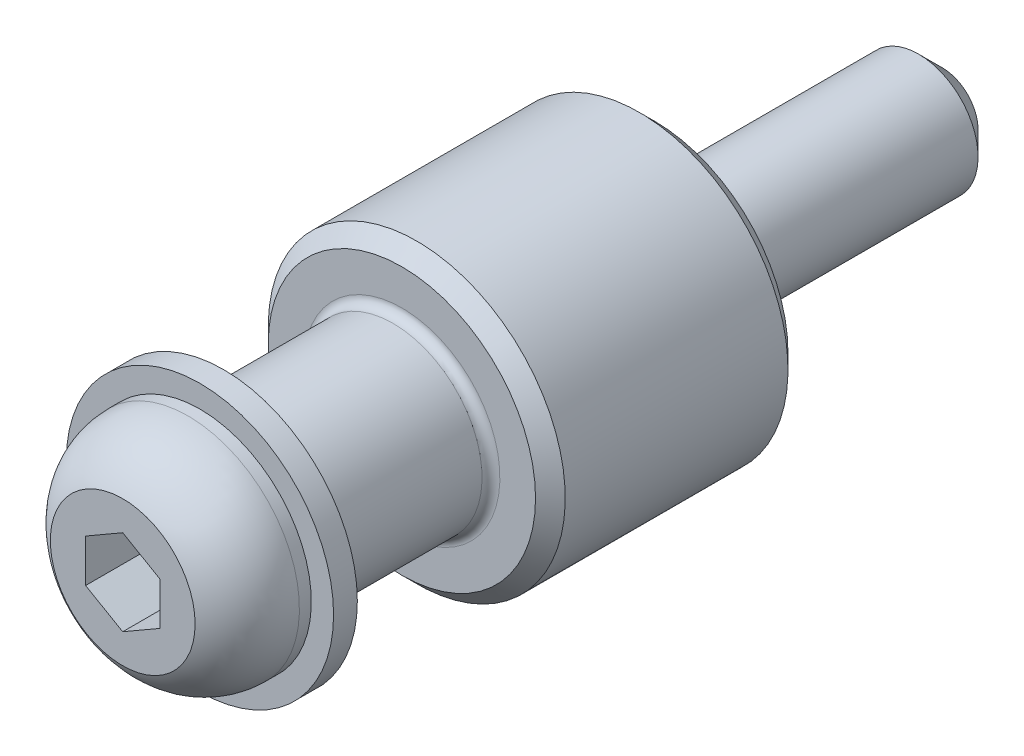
ISO-10303-21;
HEADER;
FILE_DESCRIPTION(('STEP AP214'),'2;1');
FILE_NAME('part.step','',(''),(''),'','','');
FILE_SCHEMA(('AUTOMOTIVE_DESIGN { 1 0 10303 214 1 1 1 1 }'));
ENDSEC;
DATA;
#1=APPLICATION_CONTEXT('core data for automotive mechanical design processes');
#2=APPLICATION_PROTOCOL_DEFINITION('international standard','automotive_design',2000,#1);
#3=PRODUCT_CONTEXT('',#1,'mechanical');
#4=PRODUCT('Part','Part','',(#3));
#5=PRODUCT_RELATED_PRODUCT_CATEGORY('part','',(#4));
#6=PRODUCT_DEFINITION_FORMATION('','',#4);
#7=PRODUCT_DEFINITION_CONTEXT('part definition',#1,'design');
#8=PRODUCT_DEFINITION('design','',#6,#7);
#9=PRODUCT_DEFINITION_SHAPE('','',#8);
#10=(LENGTH_UNIT() NAMED_UNIT(*) SI_UNIT(.MILLI.,.METRE.));
#11=(NAMED_UNIT(*) PLANE_ANGLE_UNIT() SI_UNIT($,.RADIAN.));
#12=(NAMED_UNIT(*) SI_UNIT($,.STERADIAN.) SOLID_ANGLE_UNIT());
#13=UNCERTAINTY_MEASURE_WITH_UNIT(LENGTH_MEASURE(1.E-05),#10,'distance_accuracy_value','');
#14=(GEOMETRIC_REPRESENTATION_CONTEXT(3) GLOBAL_UNCERTAINTY_ASSIGNED_CONTEXT((#13)) GLOBAL_UNIT_ASSIGNED_CONTEXT((#10,
#11,#12)) REPRESENTATION_CONTEXT('',''));
#15=CARTESIAN_POINT('',(0.,0.,0.));
#16=DIRECTION('',(0.,0.,1.));
#17=DIRECTION('',(1.,0.,0.));
#18=AXIS2_PLACEMENT_3D('',#15,#16,#17);
#19=CARTESIAN_POINT('',(2.5,0.,15.9));
#20=DIRECTION('',(0.,0.,1.));
#21=DIRECTION('',(-0.5,-0.866025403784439,0.));
#22=AXIS2_PLACEMENT_3D('',#19,#20,#21);
#23=PLANE('',#22);
#24=DIRECTION('',(0.866025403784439,0.5,0.));
#25=VECTOR('',#24,1.);
#26=CARTESIAN_POINT('',(0.,-1.44337567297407,15.9));
#27=LINE('',#26,#25);
#28=CARTESIAN_POINT('',(0.,-1.44337567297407,15.9));
#29=VERTEX_POINT('',#28);
#30=CARTESIAN_POINT('',(1.25,-0.721687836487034,15.9));
#31=VERTEX_POINT('',#30);
#32=EDGE_CURVE('E101',#29,#31,#27,.T.);
#33=ORIENTED_EDGE('',*,*,#32,.T.);
#34=DIRECTION('',(0.,1.,0.));
#35=VECTOR('',#34,1.);
#36=CARTESIAN_POINT('',(1.25,-0.721687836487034,15.9));
#37=LINE('',#36,#35);
#38=CARTESIAN_POINT('',(1.25,0.72168783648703,15.9));
#39=VERTEX_POINT('',#38);
#40=EDGE_CURVE('E104',#31,#39,#37,.T.);
#41=ORIENTED_EDGE('',*,*,#40,.T.);
#42=DIRECTION('',(-0.866025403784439,0.5,0.));
#43=VECTOR('',#42,1.);
#44=CARTESIAN_POINT('',(1.25,0.72168783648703,15.9));
#45=LINE('',#44,#43);
#46=CARTESIAN_POINT('',(0.,1.44337567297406,15.9));
#47=VERTEX_POINT('',#46);
#48=EDGE_CURVE('E75',#39,#47,#45,.T.);
#49=ORIENTED_EDGE('',*,*,#48,.T.);
#50=DIRECTION('',(-0.866025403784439,-0.5,0.));
#51=VECTOR('',#50,1.);
#52=CARTESIAN_POINT('',(0.,1.44337567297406,15.9));
#53=LINE('',#52,#51);
#54=CARTESIAN_POINT('',(-1.25,0.721687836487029,15.9));
#55=VERTEX_POINT('',#54);
#56=EDGE_CURVE('E107',#47,#55,#53,.T.);
#57=ORIENTED_EDGE('',*,*,#56,.T.);
#58=DIRECTION('',(0.,-1.,0.));
#59=VECTOR('',#58,1.);
#60=CARTESIAN_POINT('',(-1.25,0.721687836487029,15.9));
#61=LINE('',#60,#59);
#62=CARTESIAN_POINT('',(-1.25,-0.721687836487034,15.9));
#63=VERTEX_POINT('',#62);
#64=EDGE_CURVE('E110',#55,#63,#61,.T.);
#65=ORIENTED_EDGE('',*,*,#64,.T.);
#66=DIRECTION('',(0.866025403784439,-0.5,0.));
#67=VECTOR('',#66,1.);
#68=CARTESIAN_POINT('',(-1.25,-0.721687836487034,15.9));
#69=LINE('',#68,#67);
#70=EDGE_CURVE('E113',#63,#29,#69,.T.);
#71=ORIENTED_EDGE('',*,*,#70,.T.);
#72=EDGE_LOOP('',(#33,#41,#49,#57,#65,#71));
#73=FACE_BOUND('',#72,.T.);
#74=ADVANCED_FACE('F14',(#73),#23,.T.);
#75=CARTESIAN_POINT('',(1.25,0.72168783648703,15.9));
#76=DIRECTION('',(0.5,0.866025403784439,0.));
#77=DIRECTION('',(0.,0.,1.));
#78=AXIS2_PLACEMENT_3D('',#75,#76,#77);
#79=PLANE('',#78);
#80=DIRECTION('',(-0.866025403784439,0.5,0.));
#81=VECTOR('',#80,1.);
#82=CARTESIAN_POINT('',(1.25,0.72168783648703,17.9));
#83=LINE('',#82,#81);
#84=CARTESIAN_POINT('',(1.25,0.72168783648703,17.9));
#85=VERTEX_POINT('',#84);
#86=CARTESIAN_POINT('',(0.,1.44337567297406,17.9));
#87=VERTEX_POINT('',#86);
#88=EDGE_CURVE('E72',#85,#87,#83,.T.);
#89=ORIENTED_EDGE('',*,*,#88,.T.);
#90=DIRECTION('',(0.,0.,1.));
#91=VECTOR('',#90,1.);
#92=CARTESIAN_POINT('',(0.,1.44337567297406,15.9));
#93=LINE('',#92,#91);
#94=EDGE_CURVE('E79',#47,#87,#93,.T.);
#95=ORIENTED_EDGE('',*,*,#94,.F.);
#96=ORIENTED_EDGE('',*,*,#48,.F.);
#97=DIRECTION('',(0.,0.,1.));
#98=VECTOR('',#97,1.);
#99=CARTESIAN_POINT('',(1.25,0.72168783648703,15.9));
#100=LINE('',#99,#98);
#101=EDGE_CURVE('E68',#39,#85,#100,.T.);
#102=ORIENTED_EDGE('',*,*,#101,.T.);
#103=EDGE_LOOP('',(#89,#95,#96,#102));
#104=FACE_BOUND('',#103,.T.);
#105=ADVANCED_FACE('F70',(#104),#79,.F.);
#106=CARTESIAN_POINT('',(0.,1.44337567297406,15.9));
#107=DIRECTION('',(-0.5,0.866025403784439,0.));
#108=DIRECTION('',(-0.866025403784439,-0.5,0.));
#109=AXIS2_PLACEMENT_3D('',#106,#107,#108);
#110=PLANE('',#109);
#111=DIRECTION('',(-0.866025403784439,-0.5,0.));
#112=VECTOR('',#111,1.);
#113=CARTESIAN_POINT('',(0.,1.44337567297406,17.9));
#114=LINE('',#113,#112);
#115=CARTESIAN_POINT('',(-1.25,0.72168783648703,17.9));
#116=VERTEX_POINT('',#115);
#117=EDGE_CURVE('E91',#87,#116,#114,.T.);
#118=ORIENTED_EDGE('',*,*,#117,.T.);
#119=DIRECTION('',(0.,0.,1.));
#120=VECTOR('',#119,1.);
#121=CARTESIAN_POINT('',(-1.25,0.721687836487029,15.9));
#122=LINE('',#121,#120);
#123=EDGE_CURVE('E120',#55,#116,#122,.T.);
#124=ORIENTED_EDGE('',*,*,#123,.F.);
#125=ORIENTED_EDGE('',*,*,#56,.F.);
#126=ORIENTED_EDGE('',*,*,#94,.T.);
#127=EDGE_LOOP('',(#118,#124,#125,#126));
#128=FACE_BOUND('',#127,.T.);
#129=ADVANCED_FACE('F293',(#128),#110,.F.);
#130=CARTESIAN_POINT('',(-1.25,0.721687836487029,15.9));
#131=DIRECTION('',(-1.,0.,0.));
#132=DIRECTION('',(0.,-1.,0.));
#133=AXIS2_PLACEMENT_3D('',#130,#131,#132);
#134=PLANE('',#133);
#135=DIRECTION('',(0.,-1.,0.));
#136=VECTOR('',#135,1.);
#137=CARTESIAN_POINT('',(-1.25,0.72168783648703,17.9));
#138=LINE('',#137,#136);
#139=CARTESIAN_POINT('',(-1.25,-0.721687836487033,17.9));
#140=VERTEX_POINT('',#139);
#141=EDGE_CURVE('E93',#116,#140,#138,.T.);
#142=ORIENTED_EDGE('',*,*,#141,.T.);
#143=DIRECTION('',(0.,0.,1.));
#144=VECTOR('',#143,1.);
#145=CARTESIAN_POINT('',(-1.25,-0.721687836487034,15.9));
#146=LINE('',#145,#144);
#147=EDGE_CURVE('E118',#63,#140,#146,.T.);
#148=ORIENTED_EDGE('',*,*,#147,.F.);
#149=ORIENTED_EDGE('',*,*,#64,.F.);
#150=ORIENTED_EDGE('',*,*,#123,.T.);
#151=EDGE_LOOP('',(#142,#148,#149,#150));
#152=FACE_BOUND('',#151,.T.);
#153=ADVANCED_FACE('F290',(#152),#134,.F.);
#154=CARTESIAN_POINT('',(-1.25,-0.721687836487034,15.9));
#155=DIRECTION('',(-0.5,-0.866025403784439,0.));
#156=DIRECTION('',(0.866025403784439,-0.5,0.));
#157=AXIS2_PLACEMENT_3D('',#154,#155,#156);
#158=PLANE('',#157);
#159=DIRECTION('',(0.866025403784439,-0.5,0.));
#160=VECTOR('',#159,1.);
#161=CARTESIAN_POINT('',(-1.25,-0.721687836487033,17.9));
#162=LINE('',#161,#160);
#163=CARTESIAN_POINT('',(0.,-1.44337567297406,17.9));
#164=VERTEX_POINT('',#163);
#165=EDGE_CURVE('E99',#140,#164,#162,.T.);
#166=ORIENTED_EDGE('',*,*,#165,.T.);
#167=DIRECTION('',(0.,0.,1.));
#168=VECTOR('',#167,1.);
#169=CARTESIAN_POINT('',(0.,-1.44337567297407,15.9));
#170=LINE('',#169,#168);
#171=EDGE_CURVE('E36',#29,#164,#170,.T.);
#172=ORIENTED_EDGE('',*,*,#171,.F.);
#173=ORIENTED_EDGE('',*,*,#70,.F.);
#174=ORIENTED_EDGE('',*,*,#147,.T.);
#175=EDGE_LOOP('',(#166,#172,#173,#174));
#176=FACE_BOUND('',#175,.T.);
#177=ADVANCED_FACE('F286',(#176),#158,.F.);
#178=CARTESIAN_POINT('',(0.,-1.44337567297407,15.9));
#179=DIRECTION('',(0.5,-0.866025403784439,0.));
#180=DIRECTION('',(0.866025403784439,0.5,0.));
#181=AXIS2_PLACEMENT_3D('',#178,#179,#180);
#182=PLANE('',#181);
#183=DIRECTION('',(0.866025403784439,0.5,0.));
#184=VECTOR('',#183,1.);
#185=CARTESIAN_POINT('',(0.,-1.44337567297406,17.9));
#186=LINE('',#185,#184);
#187=CARTESIAN_POINT('',(1.25,-0.721687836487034,17.9));
#188=VERTEX_POINT('',#187);
#189=EDGE_CURVE('E29',#164,#188,#186,.T.);
#190=ORIENTED_EDGE('',*,*,#189,.T.);
#191=DIRECTION('',(0.,0.,1.));
#192=VECTOR('',#191,1.);
#193=CARTESIAN_POINT('',(1.25,-0.721687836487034,15.9));
#194=LINE('',#193,#192);
#195=EDGE_CURVE('E80',#31,#188,#194,.T.);
#196=ORIENTED_EDGE('',*,*,#195,.F.);
#197=ORIENTED_EDGE('',*,*,#32,.F.);
#198=ORIENTED_EDGE('',*,*,#171,.T.);
#199=EDGE_LOOP('',(#190,#196,#197,#198));
#200=FACE_BOUND('',#199,.T.);
#201=ADVANCED_FACE('F289',(#200),#182,.F.);
#202=CARTESIAN_POINT('',(1.25,-0.721687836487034,15.9));
#203=DIRECTION('',(1.,0.,0.));
#204=DIRECTION('',(0.,1.,0.));
#205=AXIS2_PLACEMENT_3D('',#202,#203,#204);
#206=PLANE('',#205);
#207=DIRECTION('',(0.,1.,0.));
#208=VECTOR('',#207,1.);
#209=CARTESIAN_POINT('',(1.25,-0.721687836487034,17.9));
#210=LINE('',#209,#208);
#211=EDGE_CURVE('E83',#188,#85,#210,.T.);
#212=ORIENTED_EDGE('',*,*,#211,.T.);
#213=ORIENTED_EDGE('',*,*,#101,.F.);
#214=ORIENTED_EDGE('',*,*,#40,.F.);
#215=ORIENTED_EDGE('',*,*,#195,.T.);
#216=EDGE_LOOP('',(#212,#213,#214,#215));
#217=FACE_BOUND('',#216,.T.);
#218=ADVANCED_FACE('F84',(#217),#206,.F.);
#219=CARTESIAN_POINT('',(0.,0.,17.9));
#220=DIRECTION('',(0.,0.,-1.));
#221=DIRECTION('',(0.5,0.866025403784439,0.));
#222=AXIS2_PLACEMENT_3D('',#219,#220,#221);
#223=PLANE('',#222);
#224=ORIENTED_EDGE('',*,*,#211,.F.);
#225=ORIENTED_EDGE('',*,*,#189,.F.);
#226=ORIENTED_EDGE('',*,*,#165,.F.);
#227=ORIENTED_EDGE('',*,*,#141,.F.);
#228=ORIENTED_EDGE('',*,*,#117,.F.);
#229=ORIENTED_EDGE('',*,*,#88,.F.);
#230=EDGE_LOOP('',(#224,#225,#226,#227,#228,#229));
#231=FACE_BOUND('',#230,.T.);
#232=CARTESIAN_POINT('',(0.,0.,17.9));
#233=DIRECTION('',(0.,0.,1.));
#234=DIRECTION('',(-0.5,-0.866025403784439,0.));
#235=AXIS2_PLACEMENT_3D('',#232,#233,#234);
#236=CIRCLE('',#235,2.4374342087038);
#237=CARTESIAN_POINT('',(-1.2187171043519,-2.11087994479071,17.9));
#238=VERTEX_POINT('',#237);
#239=EDGE_CURVE('E126',#238,#238,#236,.T.);
#240=ORIENTED_EDGE('',*,*,#239,.T.);
#241=EDGE_LOOP('',(#240));
#242=FACE_BOUND('',#241,.T.);
#243=ADVANCED_FACE('F87',(#231,#242),#223,.F.);
#244=CARTESIAN_POINT('',(0.,0.,15.7));
#245=DIRECTION('',(0.,0.,1.));
#246=DIRECTION('',(-0.5,-0.866025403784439,0.));
#247=AXIS2_PLACEMENT_3D('',#244,#245,#246);
#248=DEGENERATE_TOROIDAL_SURFACE('',#247,1.25,2.5,.T.);
#249=ORIENTED_EDGE('',*,*,#239,.F.);
#250=EDGE_LOOP('',(#249));
#251=FACE_BOUND('',#250,.T.);
#252=CARTESIAN_POINT('',(0.,0.,15.7));
#253=DIRECTION('',(0.,0.,1.));
#254=DIRECTION('',(-0.5,-0.866025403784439,0.));
#255=AXIS2_PLACEMENT_3D('',#252,#253,#254);
#256=CIRCLE('',#255,3.75);
#257=CARTESIAN_POINT('',(-1.875,-3.24759526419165,15.7));
#258=VERTEX_POINT('',#257);
#259=EDGE_CURVE('E129',#258,#258,#256,.T.);
#260=ORIENTED_EDGE('',*,*,#259,.T.);
#261=EDGE_LOOP('',(#260));
#262=FACE_BOUND('',#261,.T.);
#263=ADVANCED_FACE('F169',(#251,#262),#248,.T.);
#264=CARTESIAN_POINT('',(0.,0.,17.9));
#265=DIRECTION('',(0.,0.,1.));
#266=DIRECTION('',(-0.5,-0.866025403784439,0.));
#267=AXIS2_PLACEMENT_3D('',#264,#265,#266);
#268=CYLINDRICAL_SURFACE('',#267,3.75);
#269=ORIENTED_EDGE('',*,*,#259,.F.);
#270=EDGE_LOOP('',(#269));
#271=FACE_BOUND('',#270,.T.);
#272=CARTESIAN_POINT('',(0.,0.,15.3));
#273=DIRECTION('',(0.,0.,1.));
#274=DIRECTION('',(-0.5,-0.866025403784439,0.));
#275=AXIS2_PLACEMENT_3D('',#272,#273,#274);
#276=CIRCLE('',#275,3.75);
#277=CARTESIAN_POINT('',(-1.875,-3.24759526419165,15.3));
#278=VERTEX_POINT('',#277);
#279=EDGE_CURVE('E132',#278,#278,#276,.T.);
#280=ORIENTED_EDGE('',*,*,#279,.T.);
#281=EDGE_LOOP('',(#280));
#282=FACE_BOUND('',#281,.T.);
#283=ADVANCED_FACE('F158',(#271,#282),#268,.T.);
#284=CARTESIAN_POINT('',(0.,0.,17.9));
#285=DIRECTION('',(0.,0.,1.));
#286=DIRECTION('',(-0.5,-0.866025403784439,0.));
#287=AXIS2_PLACEMENT_3D('',#284,#285,#286);
#288=CYLINDRICAL_SURFACE('',#287,2.);
#289=CARTESIAN_POINT('',(0.,0.,-8.9));
#290=DIRECTION('',(0.,0.,-1.));
#291=DIRECTION('',(0.,1.,0.));
#292=AXIS2_PLACEMENT_3D('',#289,#290,#291);
#293=CIRCLE('',#292,2.);
#294=CARTESIAN_POINT('',(0.,2.,-8.9));
#295=VERTEX_POINT('',#294);
#296=EDGE_CURVE('E9',#295,#295,#293,.F.);
#297=ORIENTED_EDGE('',*,*,#296,.T.);
#298=EDGE_LOOP('',(#297));
#299=FACE_BOUND('',#298,.T.);
#300=CARTESIAN_POINT('',(0.,0.,0.));
#301=DIRECTION('',(0.,0.,-1.));
#302=DIRECTION('',(-0.866025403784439,0.5,0.));
#303=AXIS2_PLACEMENT_3D('',#300,#301,#302);
#304=CIRCLE('',#303,2.);
#305=CARTESIAN_POINT('',(-1.73205080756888,1.,0.));
#306=VERTEX_POINT('',#305);
#307=EDGE_CURVE('E135',#306,#306,#304,.T.);
#308=ORIENTED_EDGE('',*,*,#307,.T.);
#309=EDGE_LOOP('',(#308));
#310=FACE_BOUND('',#309,.T.);
#311=ADVANCED_FACE('F155',(#299,#310),#288,.T.);
#312=CARTESIAN_POINT('',(0.,0.,15.3));
#313=DIRECTION('',(0.,0.,1.));
#314=DIRECTION('',(-0.5,-0.866025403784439,0.));
#315=AXIS2_PLACEMENT_3D('',#312,#313,#314);
#316=CIRCLE('',#315,2.);
#317=CARTESIAN_POINT('',(-1.,-1.73205080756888,15.3));
#318=VERTEX_POINT('',#317);
#319=EDGE_CURVE('E117',#318,#318,#316,.T.);
#320=ORIENTED_EDGE('',*,*,#319,.F.);
#321=EDGE_LOOP('',(#320));
#322=FACE_BOUND('',#321,.T.);
#323=CARTESIAN_POINT('',(0.,0.,14.));
#324=DIRECTION('',(0.,0.,-1.));
#325=DIRECTION('',(-0.866025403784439,0.5,0.));
#326=AXIS2_PLACEMENT_3D('',#323,#324,#325);
#327=CIRCLE('',#326,2.);
#328=CARTESIAN_POINT('',(-1.73205080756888,1.,14.));
#329=VERTEX_POINT('',#328);
#330=EDGE_CURVE('E138',#329,#329,#327,.T.);
#331=ORIENTED_EDGE('',*,*,#330,.F.);
#332=EDGE_LOOP('',(#331));
#333=FACE_BOUND('',#332,.T.);
#334=ADVANCED_FACE('F157',(#322,#333),#288,.T.);
#335=CARTESIAN_POINT('',(1.,1.73205080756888,15.3));
#336=DIRECTION('',(0.,0.,1.));
#337=DIRECTION('',(-0.5,-0.866025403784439,0.));
#338=AXIS2_PLACEMENT_3D('',#335,#336,#337);
#339=PLANE('',#338);
#340=CARTESIAN_POINT('',(0.,0.,15.3));
#341=DIRECTION('',(0.,0.,1.));
#342=DIRECTION('',(0.5,0.866025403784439,0.));
#343=AXIS2_PLACEMENT_3D('',#340,#341,#342);
#344=CIRCLE('',#343,2.15);
#345=CARTESIAN_POINT('',(1.075,1.86195461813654,15.3));
#346=VERTEX_POINT('',#345);
#347=EDGE_CURVE('E136',#346,#346,#344,.F.);
#348=ORIENTED_EDGE('',*,*,#347,.T.);
#349=EDGE_LOOP('',(#348));
#350=FACE_BOUND('',#349,.T.);
#351=ORIENTED_EDGE('',*,*,#319,.T.);
#352=EDGE_LOOP('',(#351));
#353=FACE_BOUND('',#352,.T.);
#354=ADVANCED_FACE('F166',(#350,#353),#339,.F.);
#355=CARTESIAN_POINT('',(0.,0.,15.3));
#356=DIRECTION('',(0.,0.,-1.));
#357=DIRECTION('',(-0.866025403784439,0.5,0.));
#358=AXIS2_PLACEMENT_3D('',#355,#356,#357);
#359=CYLINDRICAL_SURFACE('',#358,4.5);
#360=CARTESIAN_POINT('',(0.,0.,15.3));
#361=DIRECTION('',(0.,0.,1.));
#362=DIRECTION('',(0.866025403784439,-0.5,0.));
#363=AXIS2_PLACEMENT_3D('',#360,#361,#362);
#364=CIRCLE('',#363,4.5);
#365=CARTESIAN_POINT('',(3.89711431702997,-2.25,15.3));
#366=VERTEX_POINT('',#365);
#367=EDGE_CURVE('E256',#366,#366,#364,.T.);
#368=ORIENTED_EDGE('',*,*,#367,.F.);
#369=EDGE_LOOP('',(#368));
#370=FACE_BOUND('',#369,.T.);
#371=CARTESIAN_POINT('',(0.,0.,14.5));
#372=DIRECTION('',(0.,0.,1.));
#373=DIRECTION('',(0.866025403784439,-0.5,0.));
#374=AXIS2_PLACEMENT_3D('',#371,#372,#373);
#375=CIRCLE('',#374,4.5);
#376=CARTESIAN_POINT('',(3.89711431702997,-2.25,14.5));
#377=VERTEX_POINT('',#376);
#378=EDGE_CURVE('E253',#377,#377,#375,.T.);
#379=ORIENTED_EDGE('',*,*,#378,.T.);
#380=EDGE_LOOP('',(#379));
#381=FACE_BOUND('',#380,.T.);
#382=ADVANCED_FACE('F262',(#370,#381),#359,.T.);
#383=CARTESIAN_POINT('',(0.,0.,15.3));
#384=DIRECTION('',(0.,0.,1.));
#385=DIRECTION('',(0.866025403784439,-0.5,0.));
#386=AXIS2_PLACEMENT_3D('',#383,#384,#385);
#387=PLANE('',#386);
#388=ORIENTED_EDGE('',*,*,#367,.T.);
#389=EDGE_LOOP('',(#388));
#390=FACE_BOUND('',#389,.T.);
#391=ORIENTED_EDGE('',*,*,#279,.F.);
#392=EDGE_LOOP('',(#391));
#393=FACE_BOUND('',#392,.T.);
#394=ADVANCED_FACE('F172',(#390,#393),#387,.T.);
#395=CARTESIAN_POINT('',(0.,0.,14.5));
#396=DIRECTION('',(0.,0.,1.));
#397=DIRECTION('',(0.866025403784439,-0.5,0.));
#398=AXIS2_PLACEMENT_3D('',#395,#396,#397);
#399=PLANE('',#398);
#400=ORIENTED_EDGE('',*,*,#378,.F.);
#401=EDGE_LOOP('',(#400));
#402=FACE_BOUND('',#401,.T.);
#403=CARTESIAN_POINT('',(0.,0.,14.5));
#404=DIRECTION('',(0.,0.,1.));
#405=DIRECTION('',(0.866025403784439,-0.5,0.));
#406=AXIS2_PLACEMENT_3D('',#403,#404,#405);
#407=CIRCLE('',#406,2.15);
#408=CARTESIAN_POINT('',(1.86195461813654,-1.075,14.5));
#409=VERTEX_POINT('',#408);
#410=EDGE_CURVE('E250',#409,#409,#407,.T.);
#411=ORIENTED_EDGE('',*,*,#410,.T.);
#412=EDGE_LOOP('',(#411));
#413=FACE_BOUND('',#412,.T.);
#414=ADVANCED_FACE('F266',(#402,#413),#399,.F.);
#415=CARTESIAN_POINT('',(0.,0.,15.3));
#416=DIRECTION('',(0.,0.,-1.));
#417=DIRECTION('',(-0.866025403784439,0.5,0.));
#418=AXIS2_PLACEMENT_3D('',#415,#416,#417);
#419=CYLINDRICAL_SURFACE('',#418,2.15);
#420=ORIENTED_EDGE('',*,*,#347,.F.);
#421=EDGE_LOOP('',(#420));
#422=FACE_BOUND('',#421,.T.);
#423=ORIENTED_EDGE('',*,*,#410,.F.);
#424=EDGE_LOOP('',(#423));
#425=FACE_BOUND('',#424,.T.);
#426=ADVANCED_FACE('F153',(#422,#425),#419,.F.);
#427=CARTESIAN_POINT('',(0.,0.,8.8));
#428=DIRECTION('',(0.,0.,1.));
#429=DIRECTION('',(0.866025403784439,-0.5,0.));
#430=AXIS2_PLACEMENT_3D('',#427,#428,#429);
#431=TOROIDAL_SURFACE('',#430,3.3,0.3);
#432=CARTESIAN_POINT('',(0.,0.,8.8));
#433=DIRECTION('',(0.,0.,1.));
#434=DIRECTION('',(0.866025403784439,-0.5,0.));
#435=AXIS2_PLACEMENT_3D('',#432,#433,#434);
#436=CIRCLE('',#435,3.);
#437=CARTESIAN_POINT('',(2.59807621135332,-1.5,8.8));
#438=VERTEX_POINT('',#437);
#439=EDGE_CURVE('E232',#438,#438,#436,.T.);
#440=ORIENTED_EDGE('',*,*,#439,.F.);
#441=EDGE_LOOP('',(#440));
#442=FACE_BOUND('',#441,.T.);
#443=CARTESIAN_POINT('',(0.,0.,8.5));
#444=DIRECTION('',(0.,0.,1.));
#445=DIRECTION('',(0.866025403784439,-0.5,0.));
#446=AXIS2_PLACEMENT_3D('',#443,#444,#445);
#447=CIRCLE('',#446,3.3);
#448=CARTESIAN_POINT('',(2.85788383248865,-1.65,8.5));
#449=VERTEX_POINT('',#448);
#450=EDGE_CURVE('E241',#449,#449,#447,.F.);
#451=ORIENTED_EDGE('',*,*,#450,.F.);
#452=EDGE_LOOP('',(#451));
#453=FACE_BOUND('',#452,.T.);
#454=ADVANCED_FACE('F168',(#442,#453),#431,.F.);
#455=CARTESIAN_POINT('',(0.,0.,0.));
#456=DIRECTION('',(0.,0.,-1.));
#457=DIRECTION('',(-0.866025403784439,0.5,0.));
#458=AXIS2_PLACEMENT_3D('',#455,#456,#457);
#459=CYLINDRICAL_SURFACE('',#458,3.);
#460=ORIENTED_EDGE('',*,*,#439,.T.);
#461=EDGE_LOOP('',(#460));
#462=FACE_BOUND('',#461,.T.);
#463=CARTESIAN_POINT('',(0.,0.,13.5));
#464=DIRECTION('',(0.,0.,1.));
#465=DIRECTION('',(0.866025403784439,-0.5,0.));
#466=AXIS2_PLACEMENT_3D('',#463,#464,#465);
#467=CIRCLE('',#466,3.);
#468=CARTESIAN_POINT('',(2.59807621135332,-1.5,13.5));
#469=VERTEX_POINT('',#468);
#470=EDGE_CURVE('E235',#469,#469,#467,.F.);
#471=ORIENTED_EDGE('',*,*,#470,.T.);
#472=EDGE_LOOP('',(#471));
#473=FACE_BOUND('',#472,.T.);
#474=ADVANCED_FACE('F208',(#462,#473),#459,.T.);
#475=CARTESIAN_POINT('',(0.,0.,13.5));
#476=DIRECTION('',(0.,0.,-1.));
#477=DIRECTION('',(-0.866025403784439,0.5,0.));
#478=AXIS2_PLACEMENT_3D('',#475,#476,#477);
#479=CONICAL_SURFACE('',#478,3.,0.78539816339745);
#480=CARTESIAN_POINT('',(0.,0.,14.));
#481=DIRECTION('',(0.,0.,1.));
#482=DIRECTION('',(0.866025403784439,-0.5,0.));
#483=AXIS2_PLACEMENT_3D('',#480,#481,#482);
#484=CIRCLE('',#483,2.5);
#485=CARTESIAN_POINT('',(2.1650635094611,-1.25,14.));
#486=VERTEX_POINT('',#485);
#487=EDGE_CURVE('E237',#486,#486,#484,.T.);
#488=ORIENTED_EDGE('',*,*,#487,.F.);
#489=EDGE_LOOP('',(#488));
#490=FACE_BOUND('',#489,.T.);
#491=ORIENTED_EDGE('',*,*,#470,.F.);
#492=EDGE_LOOP('',(#491));
#493=FACE_BOUND('',#492,.T.);
#494=ADVANCED_FACE('F202',(#490,#493),#479,.T.);
#495=CARTESIAN_POINT('',(1.5,2.59807621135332,14.));
#496=DIRECTION('',(0.,0.,1.));
#497=DIRECTION('',(0.866025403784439,-0.5,0.));
#498=AXIS2_PLACEMENT_3D('',#495,#496,#497);
#499=PLANE('',#498);
#500=ORIENTED_EDGE('',*,*,#487,.T.);
#501=EDGE_LOOP('',(#500));
#502=FACE_BOUND('',#501,.T.);
#503=ORIENTED_EDGE('',*,*,#330,.T.);
#504=EDGE_LOOP('',(#503));
#505=FACE_BOUND('',#504,.T.);
#506=ADVANCED_FACE('F188',(#502,#505),#499,.T.);
#507=CARTESIAN_POINT('',(2.5,4.3301270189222,8.5));
#508=DIRECTION('',(0.,0.,1.));
#509=DIRECTION('',(0.866025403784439,-0.5,0.));
#510=AXIS2_PLACEMENT_3D('',#507,#508,#509);
#511=PLANE('',#510);
#512=ORIENTED_EDGE('',*,*,#450,.T.);
#513=EDGE_LOOP('',(#512));
#514=FACE_BOUND('',#513,.T.);
#515=CARTESIAN_POINT('',(0.,0.,8.5));
#516=DIRECTION('',(0.,0.,1.));
#517=DIRECTION('',(0.866025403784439,-0.5,0.));
#518=AXIS2_PLACEMENT_3D('',#515,#516,#517);
#519=CIRCLE('',#518,4.5);
#520=CARTESIAN_POINT('',(3.89711431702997,-2.25,8.5));
#521=VERTEX_POINT('',#520);
#522=EDGE_CURVE('E238',#521,#521,#519,.T.);
#523=ORIENTED_EDGE('',*,*,#522,.T.);
#524=EDGE_LOOP('',(#523));
#525=FACE_BOUND('',#524,.T.);
#526=ADVANCED_FACE('F195',(#514,#525),#511,.T.);
#527=CARTESIAN_POINT('',(0.,0.,8.));
#528=DIRECTION('',(0.,0.,-1.));
#529=DIRECTION('',(-0.866025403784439,0.5,0.));
#530=AXIS2_PLACEMENT_3D('',#527,#528,#529);
#531=CONICAL_SURFACE('',#530,5.,0.78539816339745);
#532=ORIENTED_EDGE('',*,*,#522,.F.);
#533=EDGE_LOOP('',(#532));
#534=FACE_BOUND('',#533,.T.);
#535=CARTESIAN_POINT('',(0.,0.,8.));
#536=DIRECTION('',(0.,0.,1.));
#537=DIRECTION('',(0.866025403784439,-0.5,0.));
#538=AXIS2_PLACEMENT_3D('',#535,#536,#537);
#539=CIRCLE('',#538,5.);
#540=CARTESIAN_POINT('',(4.3301270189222,-2.5,8.));
#541=VERTEX_POINT('',#540);
#542=EDGE_CURVE('E474',#541,#541,#539,.F.);
#543=ORIENTED_EDGE('',*,*,#542,.F.);
#544=EDGE_LOOP('',(#543));
#545=FACE_BOUND('',#544,.T.);
#546=ADVANCED_FACE('F187',(#534,#545),#531,.T.);
#547=CARTESIAN_POINT('',(0.,0.,0.));
#548=DIRECTION('',(0.,0.,-1.));
#549=DIRECTION('',(-0.866025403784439,0.5,0.));
#550=AXIS2_PLACEMENT_3D('',#547,#548,#549);
#551=CYLINDRICAL_SURFACE('',#550,5.);
#552=CARTESIAN_POINT('',(0.,0.,0.5));
#553=DIRECTION('',(0.,0.,-1.));
#554=DIRECTION('',(-0.866025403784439,0.5,0.));
#555=AXIS2_PLACEMENT_3D('',#552,#553,#554);
#556=CIRCLE('',#555,5.);
#557=CARTESIAN_POINT('',(-4.3301270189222,2.5,0.5));
#558=VERTEX_POINT('',#557);
#559=EDGE_CURVE('E244',#558,#558,#556,.F.);
#560=ORIENTED_EDGE('',*,*,#559,.T.);
#561=EDGE_LOOP('',(#560));
#562=FACE_BOUND('',#561,.T.);
#563=ORIENTED_EDGE('',*,*,#542,.T.);
#564=EDGE_LOOP('',(#563));
#565=FACE_BOUND('',#564,.T.);
#566=ADVANCED_FACE('F180',(#562,#565),#551,.T.);
#567=CARTESIAN_POINT('',(0.,0.,0.));
#568=DIRECTION('',(0.,0.,1.));
#569=DIRECTION('',(0.866025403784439,-0.5,0.));
#570=AXIS2_PLACEMENT_3D('',#567,#568,#569);
#571=CONICAL_SURFACE('',#570,4.5,0.785398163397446);
#572=ORIENTED_EDGE('',*,*,#559,.F.);
#573=EDGE_LOOP('',(#572));
#574=FACE_BOUND('',#573,.T.);
#575=CARTESIAN_POINT('',(0.,0.,0.));
#576=DIRECTION('',(0.,0.,-1.));
#577=DIRECTION('',(-0.866025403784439,0.5,0.));
#578=AXIS2_PLACEMENT_3D('',#575,#576,#577);
#579=CIRCLE('',#578,4.5);
#580=CARTESIAN_POINT('',(-3.89711431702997,2.25,0.));
#581=VERTEX_POINT('',#580);
#582=EDGE_CURVE('E472',#581,#581,#579,.T.);
#583=ORIENTED_EDGE('',*,*,#582,.F.);
#584=EDGE_LOOP('',(#583));
#585=FACE_BOUND('',#584,.T.);
#586=ADVANCED_FACE('F177',(#574,#585),#571,.T.);
#587=CARTESIAN_POINT('',(0.,0.,0.));
#588=DIRECTION('',(0.,0.,-1.));
#589=DIRECTION('',(-0.866025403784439,0.5,0.));
#590=AXIS2_PLACEMENT_3D('',#587,#588,#589);
#591=PLANE('',#590);
#592=ORIENTED_EDGE('',*,*,#582,.T.);
#593=EDGE_LOOP('',(#592));
#594=FACE_BOUND('',#593,.T.);
#595=ORIENTED_EDGE('',*,*,#307,.F.);
#596=EDGE_LOOP('',(#595));
#597=FACE_BOUND('',#596,.T.);
#598=ADVANCED_FACE('F151',(#594,#597),#591,.T.);
#599=CARTESIAN_POINT('',(0.,0.,-9.7));
#600=DIRECTION('',(0.,0.,-1.));
#601=DIRECTION('',(-1.,0.,0.));
#602=AXIS2_PLACEMENT_3D('',#599,#600,#601);
#603=PLANE('',#602);
#604=CARTESIAN_POINT('',(0.,0.,-9.7));
#605=DIRECTION('',(0.,0.,-1.));
#606=DIRECTION('',(-1.,0.,0.));
#607=AXIS2_PLACEMENT_3D('',#604,#605,#606);
#608=CIRCLE('',#607,1.2);
#609=CARTESIAN_POINT('',(-1.2,0.,-9.7));
#610=VERTEX_POINT('',#609);
#611=EDGE_CURVE('E22',#610,#610,#608,.T.);
#612=ORIENTED_EDGE('',*,*,#611,.T.);
#613=EDGE_LOOP('',(#612));
#614=FACE_BOUND('',#613,.T.);
#615=ADVANCED_FACE('F142',(#614),#603,.T.);
#616=CARTESIAN_POINT('',(0.,0.,-9.7));
#617=DIRECTION('',(0.,0.,1.));
#618=DIRECTION('',(0.,-1.,0.));
#619=AXIS2_PLACEMENT_3D('',#616,#617,#618);
#620=CONICAL_SURFACE('',#619,1.2,0.785398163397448);
#621=ORIENTED_EDGE('',*,*,#296,.F.);
#622=EDGE_LOOP('',(#621));
#623=FACE_BOUND('',#622,.T.);
#624=ORIENTED_EDGE('',*,*,#611,.F.);
#625=EDGE_LOOP('',(#624));
#626=FACE_BOUND('',#625,.T.);
#627=ADVANCED_FACE('F16',(#623,#626),#620,.T.);
#628=CLOSED_SHELL('',(#74,#105,#129,#153,#177,#201,#218,#243,#263,#283,#311,#334,#354,#382,#394,
#414,#426,#454,#474,#494,#506,#526,#546,#566,#586,#598,#615,#627));
#629=MANIFOLD_SOLID_BREP('B1',#628);
#630=ADVANCED_BREP_SHAPE_REPRESENTATION('',(#18,#629),#14);
#631=SHAPE_DEFINITION_REPRESENTATION(#9,#630);
ENDSEC;
END-ISO-10303-21;
